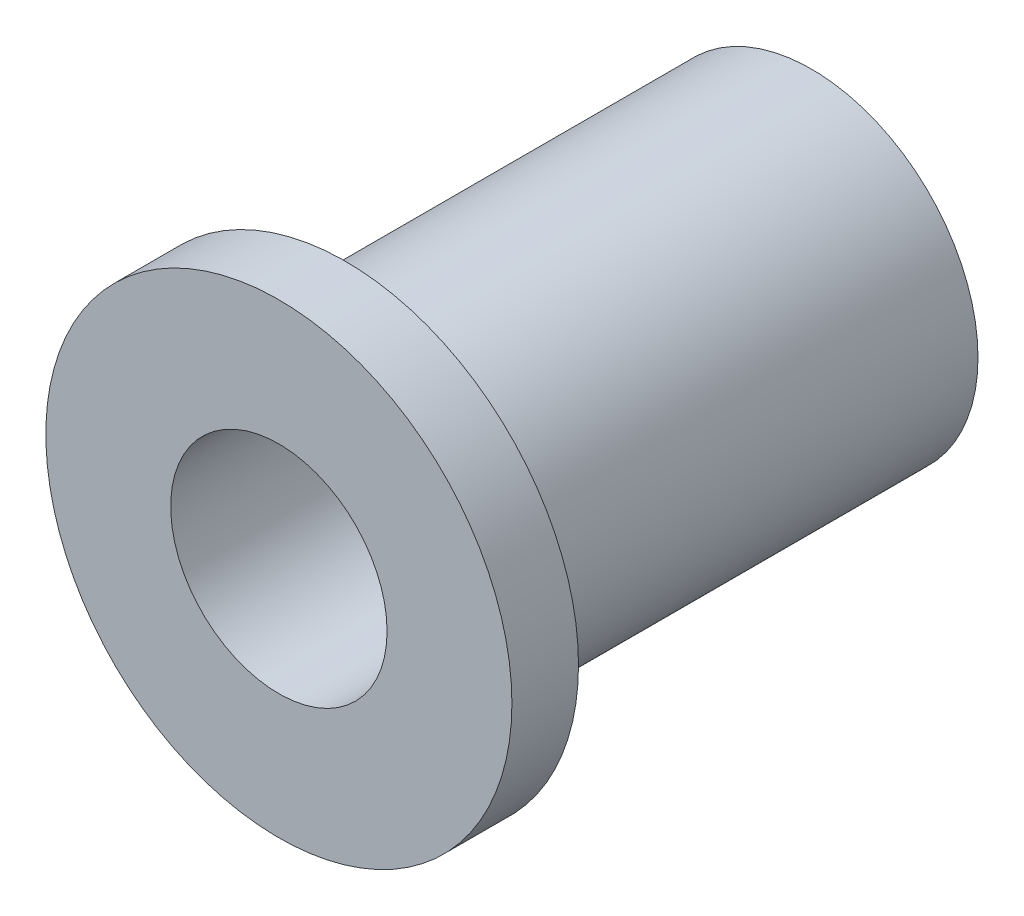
ISO-10303-21;
HEADER;
FILE_DESCRIPTION(('STEP AP214'),'2;1');
FILE_NAME('part.step','',(''),(''),'','','');
FILE_SCHEMA(('AUTOMOTIVE_DESIGN { 1 0 10303 214 1 1 1 1 }'));
ENDSEC;
DATA;
#1=APPLICATION_CONTEXT('core data for automotive mechanical design processes');
#2=APPLICATION_PROTOCOL_DEFINITION('international standard','automotive_design',2000,#1);
#3=PRODUCT_CONTEXT('',#1,'mechanical');
#4=PRODUCT('Part','Part','',(#3));
#5=PRODUCT_RELATED_PRODUCT_CATEGORY('part','',(#4));
#6=PRODUCT_DEFINITION_FORMATION('','',#4);
#7=PRODUCT_DEFINITION_CONTEXT('part definition',#1,'design');
#8=PRODUCT_DEFINITION('design','',#6,#7);
#9=PRODUCT_DEFINITION_SHAPE('','',#8);
#10=(LENGTH_UNIT() NAMED_UNIT(*) SI_UNIT(.MILLI.,.METRE.));
#11=(NAMED_UNIT(*) PLANE_ANGLE_UNIT() SI_UNIT($,.RADIAN.));
#12=(NAMED_UNIT(*) SI_UNIT($,.STERADIAN.) SOLID_ANGLE_UNIT());
#13=UNCERTAINTY_MEASURE_WITH_UNIT(LENGTH_MEASURE(1.E-05),#10,'distance_accuracy_value','');
#14=(GEOMETRIC_REPRESENTATION_CONTEXT(3) GLOBAL_UNCERTAINTY_ASSIGNED_CONTEXT((#13)) GLOBAL_UNIT_ASSIGNED_CONTEXT((#10,
#11,#12)) REPRESENTATION_CONTEXT('',''));
#15=CARTESIAN_POINT('',(0.,0.,0.));
#16=DIRECTION('',(0.,0.,1.));
#17=DIRECTION('',(1.,0.,0.));
#18=AXIS2_PLACEMENT_3D('',#15,#16,#17);
#19=CARTESIAN_POINT('',(0.,7.00000000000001,0.));
#20=DIRECTION('',(0.,0.,-1.));
#21=DIRECTION('',(-1.00000000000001,0.,0.));
#22=AXIS2_PLACEMENT_3D('',#19,#20,#21);
#23=PLANE('',#22);
#24=CARTESIAN_POINT('',(0.,0.,0.));
#25=DIRECTION('',(0.,0.,1.));
#26=DIRECTION('',(1.00000000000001,0.,0.));
#27=AXIS2_PLACEMENT_3D('',#24,#25,#26);
#28=CIRCLE('',#27,3.25);
#29=CARTESIAN_POINT('',(3.2500000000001,0.,0.));
#30=VERTEX_POINT('',#29);
#31=EDGE_CURVE('E10',#30,#30,#28,.T.);
#32=ORIENTED_EDGE('',*,*,#31,.F.);
#33=EDGE_LOOP('',(#32));
#34=FACE_BOUND('',#33,.T.);
#35=CARTESIAN_POINT('',(0.,0.,0.));
#36=DIRECTION('',(0.,0.,1.));
#37=DIRECTION('',(1.00000000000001,0.,0.));
#38=AXIS2_PLACEMENT_3D('',#35,#36,#37);
#39=CIRCLE('',#38,7.);
#40=CARTESIAN_POINT('',(7.00000000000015,0.,0.));
#41=VERTEX_POINT('',#40);
#42=EDGE_CURVE('E68',#41,#41,#39,.T.);
#43=ORIENTED_EDGE('',*,*,#42,.T.);
#44=EDGE_LOOP('',(#43));
#45=FACE_BOUND('',#44,.T.);
#46=ADVANCED_FACE('F40',(#34,#45),#23,.F.);
#47=CARTESIAN_POINT('',(0.,0.,0.));
#48=DIRECTION('',(0.,0.,1.));
#49=DIRECTION('',(1.00000000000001,0.,0.));
#50=AXIS2_PLACEMENT_3D('',#47,#48,#49);
#51=CYLINDRICAL_SURFACE('',#50,3.25);
#52=CARTESIAN_POINT('',(-3.33066907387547E-13,0.,-16.));
#53=DIRECTION('',(0.,0.,1.));
#54=DIRECTION('',(1.00000000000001,0.,0.));
#55=AXIS2_PLACEMENT_3D('',#52,#53,#54);
#56=CIRCLE('',#55,3.25);
#57=CARTESIAN_POINT('',(3.24999999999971,0.,-16.));
#58=VERTEX_POINT('',#57);
#59=EDGE_CURVE('E47',#58,#58,#56,.T.);
#60=ORIENTED_EDGE('',*,*,#59,.F.);
#61=EDGE_LOOP('',(#60));
#62=FACE_BOUND('',#61,.T.);
#63=ORIENTED_EDGE('',*,*,#31,.T.);
#64=EDGE_LOOP('',(#63));
#65=FACE_BOUND('',#64,.T.);
#66=ADVANCED_FACE('F93',(#62,#65),#51,.F.);
#67=CARTESIAN_POINT('',(-1.11022302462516E-13,3.24999999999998,-16.));
#68=DIRECTION('',(0.,0.,1.));
#69=DIRECTION('',(1.00000000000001,0.,0.));
#70=AXIS2_PLACEMENT_3D('',#67,#68,#69);
#71=PLANE('',#70);
#72=CARTESIAN_POINT('',(-3.33066907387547E-13,0.,-16.));
#73=DIRECTION('',(0.,0.,1.));
#74=DIRECTION('',(1.00000000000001,0.,0.));
#75=AXIS2_PLACEMENT_3D('',#72,#73,#74);
#76=CIRCLE('',#75,5.);
#77=CARTESIAN_POINT('',(4.99999999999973,0.,-16.));
#78=VERTEX_POINT('',#77);
#79=EDGE_CURVE('E53',#78,#78,#76,.T.);
#80=ORIENTED_EDGE('',*,*,#79,.F.);
#81=EDGE_LOOP('',(#80));
#82=FACE_BOUND('',#81,.T.);
#83=ORIENTED_EDGE('',*,*,#59,.T.);
#84=EDGE_LOOP('',(#83));
#85=FACE_BOUND('',#84,.T.);
#86=ADVANCED_FACE('F88',(#82,#85),#71,.F.);
#87=CARTESIAN_POINT('',(0.,0.,0.));
#88=DIRECTION('',(0.,0.,1.));
#89=DIRECTION('',(1.00000000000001,0.,0.));
#90=AXIS2_PLACEMENT_3D('',#87,#88,#89);
#91=CYLINDRICAL_SURFACE('',#90,5.);
#92=CARTESIAN_POINT('',(0.,0.,-2.));
#93=DIRECTION('',(0.,0.,1.));
#94=DIRECTION('',(1.00000000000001,0.,0.));
#95=AXIS2_PLACEMENT_3D('',#92,#93,#94);
#96=CIRCLE('',#95,5.);
#97=CARTESIAN_POINT('',(5.00000000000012,0.,-2.));
#98=VERTEX_POINT('',#97);
#99=EDGE_CURVE('E59',#98,#98,#96,.T.);
#100=ORIENTED_EDGE('',*,*,#99,.F.);
#101=EDGE_LOOP('',(#100));
#102=FACE_BOUND('',#101,.T.);
#103=ORIENTED_EDGE('',*,*,#79,.T.);
#104=EDGE_LOOP('',(#103));
#105=FACE_BOUND('',#104,.T.);
#106=ADVANCED_FACE('F82',(#102,#105),#91,.T.);
#107=CARTESIAN_POINT('',(-2.22044604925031E-13,4.99999999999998,-2.));
#108=DIRECTION('',(0.,0.,1.));
#109=DIRECTION('',(1.00000000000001,0.,0.));
#110=AXIS2_PLACEMENT_3D('',#107,#108,#109);
#111=PLANE('',#110);
#112=CARTESIAN_POINT('',(0.,0.,-2.));
#113=DIRECTION('',(0.,0.,1.));
#114=DIRECTION('',(1.00000000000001,0.,0.));
#115=AXIS2_PLACEMENT_3D('',#112,#113,#114);
#116=CIRCLE('',#115,7.);
#117=CARTESIAN_POINT('',(7.00000000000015,0.,-2.));
#118=VERTEX_POINT('',#117);
#119=EDGE_CURVE('E65',#118,#118,#116,.T.);
#120=ORIENTED_EDGE('',*,*,#119,.F.);
#121=EDGE_LOOP('',(#120));
#122=FACE_BOUND('',#121,.T.);
#123=ORIENTED_EDGE('',*,*,#99,.T.);
#124=EDGE_LOOP('',(#123));
#125=FACE_BOUND('',#124,.T.);
#126=ADVANCED_FACE('F76',(#122,#125),#111,.F.);
#127=CARTESIAN_POINT('',(0.,0.,0.));
#128=DIRECTION('',(0.,0.,1.));
#129=DIRECTION('',(1.00000000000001,0.,0.));
#130=AXIS2_PLACEMENT_3D('',#127,#128,#129);
#131=CYLINDRICAL_SURFACE('',#130,7.);
#132=ORIENTED_EDGE('',*,*,#42,.F.);
#133=EDGE_LOOP('',(#132));
#134=FACE_BOUND('',#133,.T.);
#135=ORIENTED_EDGE('',*,*,#119,.T.);
#136=EDGE_LOOP('',(#135));
#137=FACE_BOUND('',#136,.T.);
#138=ADVANCED_FACE('F73',(#134,#137),#131,.T.);
#139=CLOSED_SHELL('',(#46,#66,#86,#106,#126,#138));
#140=MANIFOLD_SOLID_BREP('B2',#139);
#141=ADVANCED_BREP_SHAPE_REPRESENTATION('',(#18,#140),#14);
#142=SHAPE_DEFINITION_REPRESENTATION(#9,#141);
ENDSEC;
END-ISO-10303-21;
